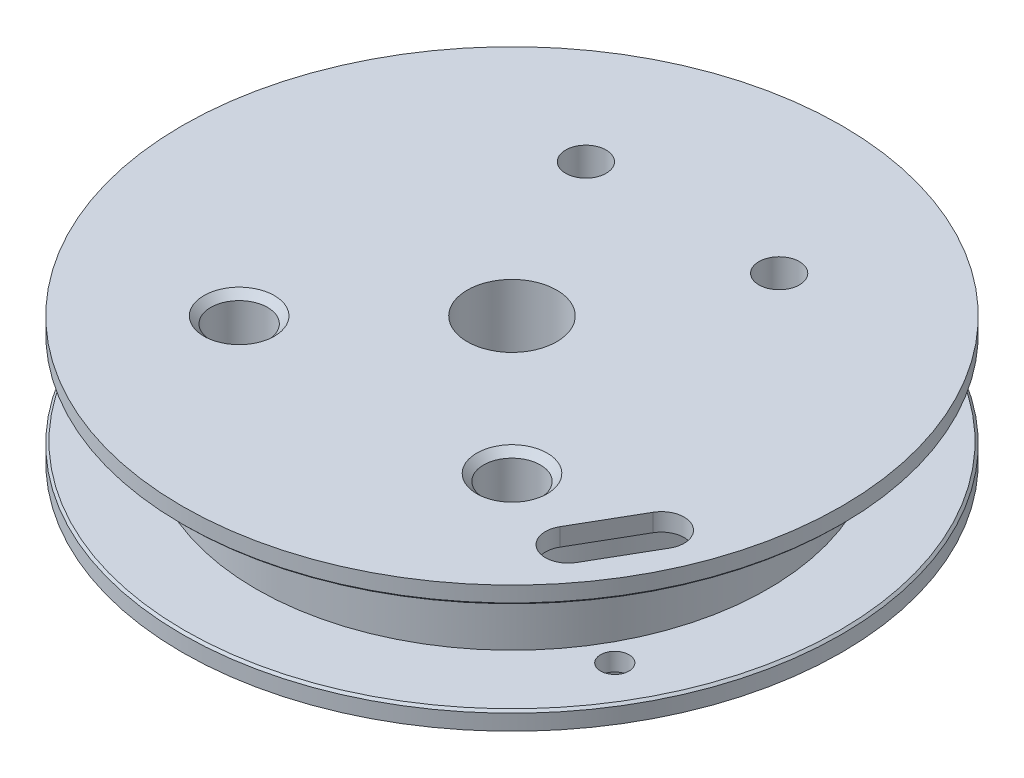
ISO-10303-21;
HEADER;
FILE_DESCRIPTION(('STEP AP214'),'2;1');
FILE_NAME('part.step','',(''),(''),'','','');
FILE_SCHEMA(('AUTOMOTIVE_DESIGN { 1 0 10303 214 1 1 1 1 }'));
ENDSEC;
DATA;
#1=APPLICATION_CONTEXT('core data for automotive mechanical design processes');
#2=APPLICATION_PROTOCOL_DEFINITION('international standard','automotive_design',2000,#1);
#3=PRODUCT_CONTEXT('',#1,'mechanical');
#4=PRODUCT('Part','Part','',(#3));
#5=PRODUCT_RELATED_PRODUCT_CATEGORY('part','',(#4));
#6=PRODUCT_DEFINITION_FORMATION('','',#4);
#7=PRODUCT_DEFINITION_CONTEXT('part definition',#1,'design');
#8=PRODUCT_DEFINITION('design','',#6,#7);
#9=PRODUCT_DEFINITION_SHAPE('','',#8);
#10=(LENGTH_UNIT() NAMED_UNIT(*) SI_UNIT(.MILLI.,.METRE.));
#11=(NAMED_UNIT(*) PLANE_ANGLE_UNIT() SI_UNIT($,.RADIAN.));
#12=(NAMED_UNIT(*) SI_UNIT($,.STERADIAN.) SOLID_ANGLE_UNIT());
#13=UNCERTAINTY_MEASURE_WITH_UNIT(LENGTH_MEASURE(1.E-05),#10,'distance_accuracy_value','');
#14=(GEOMETRIC_REPRESENTATION_CONTEXT(3) GLOBAL_UNCERTAINTY_ASSIGNED_CONTEXT((#13)) GLOBAL_UNIT_ASSIGNED_CONTEXT((#10,
#11,#12)) REPRESENTATION_CONTEXT('',''));
#15=CARTESIAN_POINT('',(0.,0.,0.));
#16=DIRECTION('',(0.,0.,1.));
#17=DIRECTION('',(1.,0.,0.));
#18=AXIS2_PLACEMENT_3D('',#15,#16,#17);
#19=CARTESIAN_POINT('',(0.,0.,0.));
#20=DIRECTION('',(0.,-1.,0.));
#21=DIRECTION('',(0.,0.,-1.));
#22=AXIS2_PLACEMENT_3D('',#19,#20,#21);
#23=CYLINDRICAL_SURFACE('',#22,9.525);
#24=CARTESIAN_POINT('',(-2.01929999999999,25.99396,9.30849356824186));
#25=CARTESIAN_POINT('',(-2.01929603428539,26.1060088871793,9.30849582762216));
#26=CARTESIAN_POINT('',(-2.00994207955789,26.2181062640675,9.31053873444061));
#27=CARTESIAN_POINT('',(-1.97281073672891,26.4391193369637,9.31847573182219));
#28=CARTESIAN_POINT('',(-1.94501950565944,26.5480325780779,9.32437271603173));
#29=CARTESIAN_POINT('',(-1.87192289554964,26.7594482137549,9.33932066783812));
#30=CARTESIAN_POINT('',(-1.82663606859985,26.8619572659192,9.34836829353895));
#31=CARTESIAN_POINT('',(-1.71988607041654,27.0579230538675,9.36859408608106));
#32=CARTESIAN_POINT('',(-1.65842344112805,27.1513800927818,9.37977218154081));
#33=CARTESIAN_POINT('',(-1.52002642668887,27.3280753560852,9.40319768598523));
#34=CARTESIAN_POINT('',(-1.44288400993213,27.4111489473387,9.41545806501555));
#35=CARTESIAN_POINT('',(-1.27576644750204,27.5632789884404,9.43955293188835));
#36=CARTESIAN_POINT('',(-1.18579034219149,27.632334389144,9.45138738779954));
#37=CARTESIAN_POINT('',(-0.994460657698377,27.7551145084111,9.47343774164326));
#38=CARTESIAN_POINT('',(-0.893003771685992,27.8086815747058,9.48363655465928));
#39=CARTESIAN_POINT('',(-0.682276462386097,27.8979454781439,9.50112028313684));
#40=CARTESIAN_POINT('',(-0.573006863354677,27.9336441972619,9.50840550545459));
#41=CARTESIAN_POINT('',(-0.351466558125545,27.985642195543,9.51914955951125));
#42=CARTESIAN_POINT('',(-0.239263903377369,28.0022198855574,9.52266325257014));
#43=CARTESIAN_POINT('',(-0.0136186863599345,28.0163750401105,9.52565820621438));
#44=CARTESIAN_POINT('',(0.0998237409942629,28.0139545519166,9.52513990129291));
#45=CARTESIAN_POINT('',(0.322811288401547,27.9903908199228,9.52017140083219));
#46=CARTESIAN_POINT('',(0.432389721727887,27.9695475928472,9.51578421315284));
#47=CARTESIAN_POINT('',(0.646457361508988,27.9102073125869,9.50364240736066));
#48=CARTESIAN_POINT('',(0.750946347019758,27.8717094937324,9.49588764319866));
#49=CARTESIAN_POINT('',(0.952710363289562,27.7778828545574,9.47777975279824));
#50=CARTESIAN_POINT('',(1.04993020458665,27.7224389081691,9.46740894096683));
#51=CARTESIAN_POINT('',(1.23379613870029,27.5963794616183,9.44520838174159));
#52=CARTESIAN_POINT('',(1.32044087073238,27.5257620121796,9.43337844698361));
#53=CARTESIAN_POINT('',(1.48248003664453,27.3697220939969,9.4092895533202));
#54=CARTESIAN_POINT('',(1.55762124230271,27.2840370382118,9.39702672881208));
#55=CARTESIAN_POINT('',(1.69251280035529,27.1011561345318,9.3736719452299));
#56=CARTESIAN_POINT('',(1.75226278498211,27.003960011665,9.36258001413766));
#57=CARTESIAN_POINT('',(1.85477896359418,26.8004235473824,9.3428135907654));
#58=CARTESIAN_POINT('',(1.89749984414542,26.6940597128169,9.33414556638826));
#59=CARTESIAN_POINT('',(1.96438678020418,26.4754362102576,9.3202997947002));
#60=CARTESIAN_POINT('',(1.98855558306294,26.3631774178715,9.31512153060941));
#61=CARTESIAN_POINT('',(2.01726482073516,26.138257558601,9.30894630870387));
#62=CARTESIAN_POINT('',(2.02217285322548,26.0256455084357,9.30787105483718));
#63=CARTESIAN_POINT('',(2.01321422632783,25.8012121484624,9.30981277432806));
#64=CARTESIAN_POINT('',(1.99934877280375,25.6893907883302,9.31282948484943));
#65=CARTESIAN_POINT('',(1.95355496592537,25.4709765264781,9.32254151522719));
#66=CARTESIAN_POINT('',(1.92182683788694,25.3643396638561,9.32919603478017));
#67=CARTESIAN_POINT('',(1.84142411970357,25.1578954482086,9.34539746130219));
#68=CARTESIAN_POINT('',(1.79274798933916,25.0580887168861,9.3549446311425));
#69=CARTESIAN_POINT('',(1.67901294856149,24.86654057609,9.37602908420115));
#70=CARTESIAN_POINT('',(1.61372627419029,24.7749374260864,9.38759326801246));
#71=CARTESIAN_POINT('',(1.46892346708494,24.6038523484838,9.41133676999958));
#72=CARTESIAN_POINT('',(1.38940567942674,24.5243718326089,9.42351615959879));
#73=CARTESIAN_POINT('',(1.21673926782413,24.378373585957,9.44737439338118));
#74=CARTESIAN_POINT('',(1.12337737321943,24.3121057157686,9.45904082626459));
#75=CARTESIAN_POINT('',(0.9266327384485,24.1961952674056,9.48033504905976));
#76=CARTESIAN_POINT('',(0.823250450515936,24.1465519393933,9.48996293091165));
#77=CARTESIAN_POINT('',(0.610022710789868,24.0656537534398,9.50604266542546));
#78=CARTESIAN_POINT('',(0.500221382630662,24.0342866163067,9.51251387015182));
#79=CARTESIAN_POINT('',(0.276755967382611,23.9904785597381,9.52163455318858));
#80=CARTESIAN_POINT('',(0.163092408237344,23.9780350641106,9.52428455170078));
#81=CARTESIAN_POINT('',(-0.0624937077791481,23.9725374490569,9.52544995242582));
#82=CARTESIAN_POINT('',(-0.174406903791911,23.9791093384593,9.52404510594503));
#83=CARTESIAN_POINT('',(-0.395495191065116,24.0106233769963,9.5174283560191));
#84=CARTESIAN_POINT('',(-0.504670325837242,24.0355652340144,9.51221651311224));
#85=CARTESIAN_POINT('',(-0.716914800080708,24.1029366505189,9.49857594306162));
#86=CARTESIAN_POINT('',(-0.82000066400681,24.145316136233,9.49015643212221));
#87=CARTESIAN_POINT('',(-1.01764972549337,24.2463097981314,9.4710023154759));
#88=CARTESIAN_POINT('',(-1.11221214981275,24.3049254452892,9.46026750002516));
#89=CARTESIAN_POINT('',(-1.29196368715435,24.4379625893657,9.43741599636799));
#90=CARTESIAN_POINT('',(-1.37695418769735,24.5126488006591,9.42527797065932));
#91=CARTESIAN_POINT('',(-1.53332402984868,24.6751692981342,9.4011072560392));
#92=CARTESIAN_POINT('',(-1.60470010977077,24.7630067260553,9.38907459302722));
#93=CARTESIAN_POINT('',(-1.73266295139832,24.9506442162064,9.36631153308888));
#94=CARTESIAN_POINT('',(-1.7890555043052,25.0505790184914,9.35559911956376));
#95=CARTESIAN_POINT('',(-1.88415679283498,25.2587101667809,9.33691305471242));
#96=CARTESIAN_POINT('',(-1.92288089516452,25.3668992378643,9.32893702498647));
#97=CARTESIAN_POINT('',(-1.97441124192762,25.5617017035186,9.3181451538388));
#98=CARTESIAN_POINT('',(-1.99121305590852,25.6472374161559,9.31454923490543));
#99=CARTESIAN_POINT('',(-2.01365873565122,25.8198257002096,9.30972261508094));
#100=CARTESIAN_POINT('',(-2.01930308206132,25.9068782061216,9.30849181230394));
#101=CARTESIAN_POINT('',(-2.01929999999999,25.99396,9.30849356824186));
#102=B_SPLINE_CURVE_WITH_KNOTS('',3,(#24,#25,#26,#27,#28,#29,#30,#31,#32,#33,#34,#35,#36,#37,
#38,#39,#40,#41,#42,#43,#44,#45,#46,#47,#48,#49,#50,#51,#52,#53,#54,#55,#56,#57,#58,#59,#60,#61,
#62,#63,#64,#65,#66,#67,#68,#69,#70,#71,#72,#73,#74,#75,#76,#77,#78,#79,#80,#81,#82,#83,#84,#85,
#86,#87,#88,#89,#90,#91,#92,#93,#94,#95,#96,#97,#98,#99,#100,#101),.UNSPECIFIED.,.T.,.F.,(4,2,2,
2,2,2,2,2,2,2,2,2,2,2,2,2,2,2,2,2,2,2,2,2,2,2,2,2,2,2,2,2,2,2,2,2,2,2,4),(0.,0.335827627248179,
0.671907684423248,1.00763234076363,1.34334575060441,1.68384405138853,2.02436782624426,
2.36824464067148,2.71208522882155,3.05085349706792,3.38958525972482,3.7229003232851,
4.05622984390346,4.39187621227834,4.72756572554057,5.06982184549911,5.41208614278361,
5.75525520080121,6.09837342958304,6.43491034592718,6.77142564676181,7.10424192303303,
7.43708845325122,7.77477121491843,8.11249327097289,8.45609694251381,8.79968511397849,
9.14113957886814,9.48254755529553,9.81728669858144,10.1520205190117,10.4857997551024,
10.8196092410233,11.1594078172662,11.4992876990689,11.8433789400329,12.187170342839,
12.4481790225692,12.7091764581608),.UNSPECIFIED.);
#103=CARTESIAN_POINT('',(-2.01929999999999,25.99396,9.30849356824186));
#104=VERTEX_POINT('',#103);
#105=EDGE_CURVE('E163',#104,#104,#102,.T.);
#106=ORIENTED_EDGE('',*,*,#105,.T.);
#107=EDGE_LOOP('',(#106));
#108=FACE_BOUND('',#107,.T.);
#109=CARTESIAN_POINT('',(0.,28.99396,0.));
#110=DIRECTION('',(0.,-1.,0.));
#111=DIRECTION('',(0.,0.,-1.));
#112=AXIS2_PLACEMENT_3D('',#109,#110,#111);
#113=CIRCLE('',#112,9.525);
#114=CARTESIAN_POINT('',(0.,28.99396,-9.525));
#115=VERTEX_POINT('',#114);
#116=EDGE_CURVE('E185',#115,#115,#113,.T.);
#117=ORIENTED_EDGE('',*,*,#116,.T.);
#118=EDGE_LOOP('',(#117));
#119=FACE_BOUND('',#118,.T.);
#120=CARTESIAN_POINT('',(0.,22.99396,0.));
#121=DIRECTION('',(0.,-1.,0.));
#122=DIRECTION('',(0.,0.,-1.));
#123=AXIS2_PLACEMENT_3D('',#120,#121,#122);
#124=CIRCLE('',#123,9.525);
#125=CARTESIAN_POINT('',(0.,22.99396,-9.525));
#126=VERTEX_POINT('',#125);
#127=EDGE_CURVE('E206',#126,#126,#124,.T.);
#128=ORIENTED_EDGE('',*,*,#127,.F.);
#129=EDGE_LOOP('',(#128));
#130=FACE_BOUND('',#129,.T.);
#131=ADVANCED_FACE('F76',(#108,#119,#130),#23,.T.);
#132=CARTESIAN_POINT('',(0.,0.,0.));
#133=DIRECTION('',(0.,-1.,0.));
#134=DIRECTION('',(0.,0.,-1.));
#135=AXIS2_PLACEMENT_3D('',#132,#133,#134);
#136=CYLINDRICAL_SURFACE('',#135,2.5);
#137=CARTESIAN_POINT('',(-2.01929999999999,25.99396,1.473915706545));
#138=CARTESIAN_POINT('',(-2.01929480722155,25.919142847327,1.47392817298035));
#139=CARTESIAN_POINT('',(-2.01509305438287,25.844201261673,1.47973177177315));
#140=CARTESIAN_POINT('',(-1.99869205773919,25.6967072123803,1.501799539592));
#141=CARTESIAN_POINT('',(-1.98646694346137,25.6241632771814,1.51809754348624));
#142=CARTESIAN_POINT('',(-1.9492780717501,25.4577362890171,1.56572883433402));
#143=CARTESIAN_POINT('',(-1.92132304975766,25.3654933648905,1.60035394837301));
#144=CARTESIAN_POINT('',(-1.85422314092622,25.1887107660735,1.67764101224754));
#145=CARTESIAN_POINT('',(-1.81504489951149,25.1041950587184,1.72032678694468));
#146=CARTESIAN_POINT('',(-1.74026753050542,24.967772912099,1.79536950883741));
#147=CARTESIAN_POINT('',(-1.70732483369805,24.9138804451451,1.82682556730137));
#148=CARTESIAN_POINT('',(-1.63673711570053,24.8096324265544,1.89033056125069));
#149=CARTESIAN_POINT('',(-1.59909033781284,24.7592782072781,1.92237971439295));
#150=CARTESIAN_POINT('',(-1.47926544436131,24.6136937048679,2.01796161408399));
#151=CARTESIAN_POINT('',(-1.39008353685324,24.5237249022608,2.08105533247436));
#152=CARTESIAN_POINT('',(-1.2133292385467,24.3766076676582,2.18775655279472));
#153=CARTESIAN_POINT('',(-1.12903037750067,24.3164965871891,2.23273276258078));
#154=CARTESIAN_POINT('',(-0.949376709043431,24.2086912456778,2.31481868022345));
#155=CARTESIAN_POINT('',(-0.854039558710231,24.1609775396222,2.35194069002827));
#156=CARTESIAN_POINT('',(-0.670326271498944,24.087034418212,2.41005502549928));
#157=CARTESIAN_POINT('',(-0.583378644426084,24.0585634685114,2.43269514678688));
#158=CARTESIAN_POINT('',(-0.404602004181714,24.0134678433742,2.46872242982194));
#159=CARTESIAN_POINT('',(-0.312775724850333,23.996836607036,2.48211471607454));
#160=CARTESIAN_POINT('',(-0.126426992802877,23.9764363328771,2.4985580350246));
#161=CARTESIAN_POINT('',(-0.0318960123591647,23.9727138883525,2.50157160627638));
#162=CARTESIAN_POINT('',(0.156486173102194,23.9785283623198,2.49687588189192));
#163=CARTESIAN_POINT('',(0.250337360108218,23.988065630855,2.48916630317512));
#164=CARTESIAN_POINT('',(0.429140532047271,24.0188209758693,2.46445221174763));
#165=CARTESIAN_POINT('',(0.514294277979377,24.0393382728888,2.44800573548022));
#166=CARTESIAN_POINT('',(0.679541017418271,24.0904672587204,2.4073786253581));
#167=CARTESIAN_POINT('',(0.759632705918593,24.1210815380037,2.38319600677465));
#168=CARTESIAN_POINT('',(0.920770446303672,24.1944278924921,2.32597640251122));
#169=CARTESIAN_POINT('',(1.00119655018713,24.2380294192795,2.29232018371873));
#170=CARTESIAN_POINT('',(1.15369505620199,24.334230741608,2.21949122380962));
#171=CARTESIAN_POINT('',(1.22576310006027,24.3868351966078,2.18031562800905));
#172=CARTESIAN_POINT('',(1.37523874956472,24.5115192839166,2.08993667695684));
#173=CARTESIAN_POINT('',(1.45066899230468,24.5853767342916,2.03792128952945));
#174=CARTESIAN_POINT('',(1.58880440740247,24.7432404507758,1.9321670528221));
#175=CARTESIAN_POINT('',(1.65149250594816,24.8272600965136,1.87842600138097));
#176=CARTESIAN_POINT('',(1.75958628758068,24.9985104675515,1.77733312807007));
#177=CARTESIAN_POINT('',(1.80592689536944,25.0850448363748,1.7298026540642));
#178=CARTESIAN_POINT('',(1.8864585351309,25.266849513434,1.64159022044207));
#179=CARTESIAN_POINT('',(1.92067607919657,25.3621001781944,1.60089342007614));
#180=CARTESIAN_POINT('',(1.96632640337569,25.5291809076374,1.54416456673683));
#181=CARTESIAN_POINT('',(1.98154800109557,25.5986796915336,1.52440993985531));
#182=CARTESIAN_POINT('',(2.00464734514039,25.7407522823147,1.49390856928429));
#183=CARTESIAN_POINT('',(2.01254234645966,25.8133184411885,1.48314066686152));
#184=CARTESIAN_POINT('',(2.02036345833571,25.9602168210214,1.47247617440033));
#185=CARTESIAN_POINT('',(2.02023580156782,26.0345576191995,1.47265293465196));
#186=CARTESIAN_POINT('',(2.01188939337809,26.1819590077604,1.48402871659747));
#187=CARTESIAN_POINT('',(2.00365994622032,26.2550177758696,1.49524230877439));
#188=CARTESIAN_POINT('',(1.97703934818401,26.4145281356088,1.53032338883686));
#189=CARTESIAN_POINT('',(1.95672334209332,26.5001210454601,1.55653509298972));
#190=CARTESIAN_POINT('',(1.90644977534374,26.6651619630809,1.61771969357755));
#191=CARTESIAN_POINT('',(1.87646281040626,26.7445903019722,1.65271923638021));
#192=CARTESIAN_POINT('',(1.79115590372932,26.9346478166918,1.74568689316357));
#193=CARTESIAN_POINT('',(1.73061991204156,27.0415265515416,1.80651395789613));
#194=CARTESIAN_POINT('',(1.59198575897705,27.2421681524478,1.92983341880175));
#195=CARTESIAN_POINT('',(1.51386486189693,27.3359137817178,1.99232787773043));
#196=CARTESIAN_POINT('',(1.33868834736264,27.510893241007,2.11412370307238));
#197=CARTESIAN_POINT('',(1.24130762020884,27.5918619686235,2.17334407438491));
#198=CARTESIAN_POINT('',(1.02924522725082,27.7359503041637,2.28138266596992));
#199=CARTESIAN_POINT('',(0.914620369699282,27.7991266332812,2.33023381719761));
#200=CARTESIAN_POINT('',(0.709566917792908,27.8866429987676,2.39879190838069));
#201=CARTESIAN_POINT('',(0.623112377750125,27.9169420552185,2.42282352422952));
#202=CARTESIAN_POINT('',(0.444963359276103,27.9657827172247,2.46176594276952));
#203=CARTESIAN_POINT('',(0.353272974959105,27.9843333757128,2.47668376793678));
#204=CARTESIAN_POINT('',(0.166706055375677,28.0085725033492,2.49620492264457));
#205=CARTESIAN_POINT('',(0.0718178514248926,28.0142071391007,2.50076508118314));
#206=CARTESIAN_POINT('',(-0.117708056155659,28.0120521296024,2.49902432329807));
#207=CARTESIAN_POINT('',(-0.212345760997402,28.0042625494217,2.49272345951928));
#208=CARTESIAN_POINT('',(-0.392478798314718,27.9767152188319,2.47056373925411));
#209=CARTESIAN_POINT('',(-0.478175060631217,27.9577396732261,2.45532988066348));
#210=CARTESIAN_POINT('',(-0.644740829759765,27.9095294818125,2.41694473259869));
#211=CARTESIAN_POINT('',(-0.725609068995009,27.880292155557,2.39379137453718));
#212=CARTESIAN_POINT('',(-0.887671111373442,27.8100145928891,2.33879505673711));
#213=CARTESIAN_POINT('',(-0.968331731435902,27.7681944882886,2.30638921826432));
#214=CARTESIAN_POINT('',(-1.12154463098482,27.6755476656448,2.23590280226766));
#215=CARTESIAN_POINT('',(-1.19409338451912,27.6247170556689,2.19781977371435));
#216=CARTESIAN_POINT('',(-1.34451441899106,27.5042338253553,2.10981567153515));
#217=CARTESIAN_POINT('',(-1.4205080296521,27.4328528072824,2.05905632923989));
#218=CARTESIAN_POINT('',(-1.5601644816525,27.280114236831,1.95536659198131));
#219=CARTESIAN_POINT('',(-1.62380894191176,27.1987421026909,1.90243310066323));
#220=CARTESIAN_POINT('',(-1.73723779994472,27.0282979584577,1.79937292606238));
#221=CARTESIAN_POINT('',(-1.78728237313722,26.9394207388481,1.749210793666));
#222=CARTESIAN_POINT('',(-1.87436590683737,26.7522075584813,1.65554058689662));
#223=CARTESIAN_POINT('',(-1.91142967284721,26.6538901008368,1.61201991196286));
#224=CARTESIAN_POINT('',(-1.96080868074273,26.4817726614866,1.55120482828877));
#225=CARTESIAN_POINT('',(-1.97725454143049,26.4105688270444,1.52999393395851));
#226=CARTESIAN_POINT('',(-2.00240730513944,26.2647970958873,1.49693379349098));
#227=CARTESIAN_POINT('',(-2.01114425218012,26.1902434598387,1.48504822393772));
#228=CARTESIAN_POINT('',(-2.01687486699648,26.0949488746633,1.47723289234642));
#229=CARTESIAN_POINT('',(-2.01778274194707,26.0747861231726,1.47599261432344));
#230=CARTESIAN_POINT('',(-2.01899607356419,26.0344052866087,1.47433225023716));
#231=CARTESIAN_POINT('',(-2.01930140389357,26.014187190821,1.47391233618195));
#232=CARTESIAN_POINT('',(-2.01929999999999,25.99396,1.473915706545));
#233=B_SPLINE_CURVE_WITH_KNOTS('',3,(#137,#138,#139,#140,#141,#142,#143,#144,#145,#146,#147,
#148,#149,#150,#151,#152,#153,#154,#155,#156,#157,#158,#159,#160,#161,#162,#163,#164,#165,#166,
#167,#168,#169,#170,#171,#172,#173,#174,#175,#176,#177,#178,#179,#180,#181,#182,#183,#184,#185,
#186,#187,#188,#189,#190,#191,#192,#193,#194,#195,#196,#197,#198,#199,#200,#201,#202,#203,#204,
#205,#206,#207,#208,#209,#210,#211,#212,#213,#214,#215,#216,#217,#218,#219,#220,#221,#222,#223,
#224,#225,#226,#227,#228,#229,#230,#231,#232),.UNSPECIFIED.,.T.,.F.,(4,2,2,2,2,2,2,2,2,2,2,2,2,
2,2,2,2,2,2,2,2,2,2,2,2,2,2,2,2,2,2,2,2,2,2,2,2,2,2,2,2,2,2,2,2,2,2,4),(0.,0.224362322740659,
0.449451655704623,0.754990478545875,1.06144693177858,1.27288816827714,1.48440860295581,
1.90662570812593,2.2440511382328,2.58094408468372,2.86250451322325,3.14390879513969,
3.42632773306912,3.70875412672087,3.97499404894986,4.24130233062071,4.53268072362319,
4.82421037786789,5.17602246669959,5.52830290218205,5.85454510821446,6.18006938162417,
6.4008027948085,6.62101502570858,6.84270326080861,7.06468455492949,7.33852607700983,
7.61320818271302,8.02229646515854,8.43191673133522,8.84915467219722,9.26504702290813,
9.5480293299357,9.83079331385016,10.1147337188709,10.3986727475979,10.6647829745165,
10.9309627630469,11.2192984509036,11.5077589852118,11.8544132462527,12.2015795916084,
12.5415427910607,12.8808527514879,13.1083575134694,13.3349716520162,13.3956164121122,
13.4562738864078),.UNSPECIFIED.);
#234=CARTESIAN_POINT('',(-2.01929999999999,25.99396,1.473915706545));
#235=VERTEX_POINT('',#234);
#236=EDGE_CURVE('E80',#235,#235,#233,.T.);
#237=ORIENTED_EDGE('',*,*,#236,.T.);
#238=EDGE_LOOP('',(#237));
#239=FACE_BOUND('',#238,.T.);
#240=CARTESIAN_POINT('',(0.,22.99396,0.));
#241=DIRECTION('',(0.,-1.,0.));
#242=DIRECTION('',(0.,0.,-1.));
#243=AXIS2_PLACEMENT_3D('',#240,#241,#242);
#244=CIRCLE('',#243,2.5);
#245=CARTESIAN_POINT('',(0.,22.99396,-2.5));
#246=VERTEX_POINT('',#245);
#247=EDGE_CURVE('E203',#246,#246,#244,.T.);
#248=ORIENTED_EDGE('',*,*,#247,.T.);
#249=EDGE_LOOP('',(#248));
#250=FACE_BOUND('',#249,.T.);
#251=CARTESIAN_POINT('',(0.,36.06456,0.));
#252=DIRECTION('',(0.,-1.,0.));
#253=DIRECTION('',(0.,0.,-1.));
#254=AXIS2_PLACEMENT_3D('',#251,#252,#253);
#255=CIRCLE('',#254,2.5);
#256=CARTESIAN_POINT('',(0.,36.06456,-2.5));
#257=VERTEX_POINT('',#256);
#258=EDGE_CURVE('E200',#257,#257,#255,.T.);
#259=ORIENTED_EDGE('',*,*,#258,.F.);
#260=EDGE_LOOP('',(#259));
#261=FACE_BOUND('',#260,.T.);
#262=ADVANCED_FACE('F260',(#239,#250,#261),#136,.F.);
#263=CARTESIAN_POINT('',(-2.5,22.99396,0.));
#264=DIRECTION('',(0.,1.,0.));
#265=DIRECTION('',(0.,0.,1.));
#266=AXIS2_PLACEMENT_3D('',#263,#264,#265);
#267=PLANE('',#266);
#268=ORIENTED_EDGE('',*,*,#247,.F.);
#269=EDGE_LOOP('',(#268));
#270=FACE_BOUND('',#269,.T.);
#271=ORIENTED_EDGE('',*,*,#127,.T.);
#272=EDGE_LOOP('',(#271));
#273=FACE_BOUND('',#272,.T.);
#274=ADVANCED_FACE('F266',(#270,#273),#267,.F.);
#275=CARTESIAN_POINT('',(-18.415,36.06456,0.));
#276=DIRECTION('',(0.,-1.,0.));
#277=DIRECTION('',(0.,0.,-1.));
#278=AXIS2_PLACEMENT_3D('',#275,#276,#277);
#279=PLANE('',#278);
#280=CARTESIAN_POINT('',(7.62,36.06456,7.62));
#281=DIRECTION('',(0.,-1.,0.));
#282=DIRECTION('',(0.,0.,-1.));
#283=AXIS2_PLACEMENT_3D('',#280,#281,#282);
#284=CIRCLE('',#283,1.9685);
#285=CARTESIAN_POINT('',(7.62,36.06456,5.6515));
#286=VERTEX_POINT('',#285);
#287=EDGE_CURVE('E89',#286,#286,#284,.T.);
#288=ORIENTED_EDGE('',*,*,#287,.T.);
#289=EDGE_LOOP('',(#288));
#290=FACE_BOUND('',#289,.T.);
#291=CARTESIAN_POINT('',(-7.61999999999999,36.06456,7.62));
#292=DIRECTION('',(0.,-1.,0.));
#293=DIRECTION('',(0.,0.,-1.));
#294=AXIS2_PLACEMENT_3D('',#291,#292,#293);
#295=CIRCLE('',#294,1.9685);
#296=CARTESIAN_POINT('',(-7.61999999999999,36.06456,5.6515));
#297=VERTEX_POINT('',#296);
#298=EDGE_CURVE('E226',#297,#297,#295,.T.);
#299=ORIENTED_EDGE('',*,*,#298,.T.);
#300=EDGE_LOOP('',(#299));
#301=FACE_BOUND('',#300,.T.);
#302=DIRECTION('',(-0.499999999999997,0.,0.866025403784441));
#303=VECTOR('',#302,1.);
#304=CARTESIAN_POINT('',(13.4358231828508,36.06456,5.55747160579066));
#305=LINE('',#304,#303);
#306=CARTESIAN_POINT('',(13.4358231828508,36.06456,5.55747160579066));
#307=VERTEX_POINT('',#306);
#308=CARTESIAN_POINT('',(11.5308231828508,36.06456,8.85702839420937));
#309=VERTEX_POINT('',#308);
#310=EDGE_CURVE('E579',#307,#309,#305,.T.);
#311=ORIENTED_EDGE('',*,*,#310,.F.);
#312=CARTESIAN_POINT('',(14.535675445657,36.06456,6.19247160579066));
#313=DIRECTION('',(0.,1.,0.));
#314=DIRECTION('',(0.,0.,1.));
#315=AXIS2_PLACEMENT_3D('',#312,#313,#314);
#316=CIRCLE('',#315,1.27000000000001);
#317=CARTESIAN_POINT('',(15.6355277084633,36.06456,6.82747160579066));
#318=VERTEX_POINT('',#317);
#319=EDGE_CURVE('E96',#318,#307,#316,.T.);
#320=ORIENTED_EDGE('',*,*,#319,.F.);
#321=DIRECTION('',(0.499999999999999,0.,-0.866025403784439));
#322=VECTOR('',#321,1.);
#323=CARTESIAN_POINT('',(15.6355277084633,36.06456,6.82747160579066));
#324=LINE('',#323,#322);
#325=CARTESIAN_POINT('',(13.7305277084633,36.06456,10.1270283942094));
#326=VERTEX_POINT('',#325);
#327=EDGE_CURVE('E140',#326,#318,#324,.T.);
#328=ORIENTED_EDGE('',*,*,#327,.F.);
#329=CARTESIAN_POINT('',(12.630675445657,36.06456,9.49202839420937));
#330=DIRECTION('',(0.,1.,0.));
#331=DIRECTION('',(0.,0.,1.));
#332=AXIS2_PLACEMENT_3D('',#329,#330,#331);
#333=CIRCLE('',#332,1.27);
#334=EDGE_CURVE('E586',#309,#326,#333,.T.);
#335=ORIENTED_EDGE('',*,*,#334,.F.);
#336=EDGE_LOOP('',(#311,#320,#328,#335));
#337=FACE_BOUND('',#336,.T.);
#338=CARTESIAN_POINT('',(5.3975,36.06456,-9.525));
#339=DIRECTION('',(0.,1.,0.));
#340=DIRECTION('',(0.,0.,1.));
#341=AXIS2_PLACEMENT_3D('',#338,#339,#340);
#342=CIRCLE('',#341,1.1303);
#343=CARTESIAN_POINT('',(5.3975,36.06456,-8.3947));
#344=VERTEX_POINT('',#343);
#345=EDGE_CURVE('E155',#344,#344,#342,.T.);
#346=ORIENTED_EDGE('',*,*,#345,.F.);
#347=EDGE_LOOP('',(#346));
#348=FACE_BOUND('',#347,.T.);
#349=CARTESIAN_POINT('',(-5.3975,36.06456,-9.525));
#350=DIRECTION('',(0.,1.,0.));
#351=DIRECTION('',(0.,0.,1.));
#352=AXIS2_PLACEMENT_3D('',#349,#350,#351);
#353=CIRCLE('',#352,1.1303);
#354=CARTESIAN_POINT('',(-5.3975,36.06456,-8.3947));
#355=VERTEX_POINT('',#354);
#356=EDGE_CURVE('E169',#355,#355,#353,.T.);
#357=ORIENTED_EDGE('',*,*,#356,.F.);
#358=EDGE_LOOP('',(#357));
#359=FACE_BOUND('',#358,.T.);
#360=CARTESIAN_POINT('',(0.,36.06456,0.));
#361=DIRECTION('',(0.,-1.,0.));
#362=DIRECTION('',(0.,0.,-1.));
#363=AXIS2_PLACEMENT_3D('',#360,#361,#362);
#364=CIRCLE('',#363,18.415);
#365=CARTESIAN_POINT('',(0.,36.06456,-18.415));
#366=VERTEX_POINT('',#365);
#367=EDGE_CURVE('E197',#366,#366,#364,.T.);
#368=ORIENTED_EDGE('',*,*,#367,.F.);
#369=EDGE_LOOP('',(#368));
#370=FACE_BOUND('',#369,.T.);
#371=ORIENTED_EDGE('',*,*,#258,.T.);
#372=EDGE_LOOP('',(#371));
#373=FACE_BOUND('',#372,.T.);
#374=ADVANCED_FACE('F232',(#290,#301,#337,#348,#359,#370,#373),#279,.F.);
#375=CARTESIAN_POINT('',(0.,0.,0.));
#376=DIRECTION('',(0.,-1.,0.));
#377=DIRECTION('',(0.,0.,-1.));
#378=AXIS2_PLACEMENT_3D('',#375,#376,#377);
#379=CYLINDRICAL_SURFACE('',#378,18.415);
#380=CARTESIAN_POINT('',(0.,35.20096,0.));
#381=DIRECTION('',(0.,1.,0.));
#382=DIRECTION('',(0.,0.,1.));
#383=AXIS2_PLACEMENT_3D('',#380,#381,#382);
#384=CIRCLE('',#383,18.415);
#385=CARTESIAN_POINT('',(0.,35.20096,18.415));
#386=VERTEX_POINT('',#385);
#387=EDGE_CURVE('E214',#386,#386,#384,.T.);
#388=ORIENTED_EDGE('',*,*,#387,.T.);
#389=EDGE_LOOP('',(#388));
#390=FACE_BOUND('',#389,.T.);
#391=ORIENTED_EDGE('',*,*,#367,.T.);
#392=EDGE_LOOP('',(#391));
#393=FACE_BOUND('',#392,.T.);
#394=ADVANCED_FACE('F457',(#390,#393),#379,.T.);
#395=CARTESIAN_POINT('',(-14.2875,35.07396,0.));
#396=DIRECTION('',(0.,1.,0.));
#397=DIRECTION('',(0.,0.,1.));
#398=AXIS2_PLACEMENT_3D('',#395,#396,#397);
#399=PLANE('',#398);
#400=CARTESIAN_POINT('',(0.,35.07396,0.));
#401=DIRECTION('',(0.,1.,0.));
#402=DIRECTION('',(0.,0.,1.));
#403=AXIS2_PLACEMENT_3D('',#400,#401,#402);
#404=CIRCLE('',#403,18.288);
#405=CARTESIAN_POINT('',(0.,35.07396,18.288));
#406=VERTEX_POINT('',#405);
#407=EDGE_CURVE('E209',#406,#406,#404,.F.);
#408=ORIENTED_EDGE('',*,*,#407,.T.);
#409=EDGE_LOOP('',(#408));
#410=FACE_BOUND('',#409,.T.);
#411=DIRECTION('',(-0.499999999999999,0.,0.866025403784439));
#412=VECTOR('',#411,1.);
#413=CARTESIAN_POINT('',(15.6355277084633,35.07396,6.82747160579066));
#414=LINE('',#413,#412);
#415=CARTESIAN_POINT('',(15.6355277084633,35.07396,6.82747160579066));
#416=VERTEX_POINT('',#415);
#417=CARTESIAN_POINT('',(13.7305277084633,35.07396,10.1270283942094));
#418=VERTEX_POINT('',#417);
#419=EDGE_CURVE('E138',#416,#418,#414,.T.);
#420=ORIENTED_EDGE('',*,*,#419,.F.);
#421=CARTESIAN_POINT('',(14.535675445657,35.07396,6.19247160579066));
#422=DIRECTION('',(0.,1.,0.));
#423=DIRECTION('',(0.,0.,1.));
#424=AXIS2_PLACEMENT_3D('',#421,#422,#423);
#425=CIRCLE('',#424,1.27000000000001);
#426=CARTESIAN_POINT('',(13.4358231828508,35.07396,5.55747160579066));
#427=VERTEX_POINT('',#426);
#428=EDGE_CURVE('E145',#427,#416,#425,.F.);
#429=ORIENTED_EDGE('',*,*,#428,.F.);
#430=DIRECTION('',(0.499999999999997,0.,-0.86602540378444));
#431=VECTOR('',#430,1.);
#432=CARTESIAN_POINT('',(13.4358231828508,35.07396,5.55747160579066));
#433=LINE('',#432,#431);
#434=CARTESIAN_POINT('',(11.5308231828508,35.07396,8.85702839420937));
#435=VERTEX_POINT('',#434);
#436=EDGE_CURVE('E150',#435,#427,#433,.T.);
#437=ORIENTED_EDGE('',*,*,#436,.F.);
#438=CARTESIAN_POINT('',(12.630675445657,35.07396,9.49202839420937));
#439=DIRECTION('',(0.,1.,0.));
#440=DIRECTION('',(0.,0.,1.));
#441=AXIS2_PLACEMENT_3D('',#438,#439,#440);
#442=CIRCLE('',#441,1.27);
#443=EDGE_CURVE('E104',#418,#435,#442,.F.);
#444=ORIENTED_EDGE('',*,*,#443,.F.);
#445=EDGE_LOOP('',(#420,#429,#437,#444));
#446=FACE_BOUND('',#445,.T.);
#447=CARTESIAN_POINT('',(0.,35.07396,0.));
#448=DIRECTION('',(0.,-1.,0.));
#449=DIRECTION('',(0.,0.,-1.));
#450=AXIS2_PLACEMENT_3D('',#447,#448,#449);
#451=CIRCLE('',#450,14.2875);
#452=CARTESIAN_POINT('',(0.,35.07396,-14.2875));
#453=VERTEX_POINT('',#452);
#454=EDGE_CURVE('E194',#453,#453,#451,.T.);
#455=ORIENTED_EDGE('',*,*,#454,.F.);
#456=EDGE_LOOP('',(#455));
#457=FACE_BOUND('',#456,.T.);
#458=ADVANCED_FACE('F152',(#410,#446,#457),#399,.F.);
#459=CARTESIAN_POINT('',(0.,0.,0.));
#460=DIRECTION('',(0.,-1.,0.));
#461=DIRECTION('',(0.,0.,-1.));
#462=AXIS2_PLACEMENT_3D('',#459,#460,#461);
#463=CYLINDRICAL_SURFACE('',#462,14.2875);
#464=CARTESIAN_POINT('',(0.,29.99396,0.));
#465=DIRECTION('',(0.,-1.,0.));
#466=DIRECTION('',(0.,0.,-1.));
#467=AXIS2_PLACEMENT_3D('',#464,#465,#466);
#468=CIRCLE('',#467,14.2875);
#469=CARTESIAN_POINT('',(0.,29.99396,-14.2875));
#470=VERTEX_POINT('',#469);
#471=EDGE_CURVE('E191',#470,#470,#468,.T.);
#472=ORIENTED_EDGE('',*,*,#471,.F.);
#473=EDGE_LOOP('',(#472));
#474=FACE_BOUND('',#473,.T.);
#475=ORIENTED_EDGE('',*,*,#454,.T.);
#476=EDGE_LOOP('',(#475));
#477=FACE_BOUND('',#476,.T.);
#478=ADVANCED_FACE('F470',(#474,#477),#463,.T.);
#479=CARTESIAN_POINT('',(-18.415,29.99396,0.));
#480=DIRECTION('',(0.,-1.,0.));
#481=DIRECTION('',(0.,0.,-1.));
#482=AXIS2_PLACEMENT_3D('',#479,#480,#481);
#483=PLANE('',#482);
#484=CARTESIAN_POINT('',(0.,29.99396,0.));
#485=DIRECTION('',(0.,-1.,0.));
#486=DIRECTION('',(0.,0.,-1.));
#487=AXIS2_PLACEMENT_3D('',#484,#485,#486);
#488=CIRCLE('',#487,18.288);
#489=CARTESIAN_POINT('',(0.,29.99396,-18.288));
#490=VERTEX_POINT('',#489);
#491=EDGE_CURVE('E220',#490,#490,#488,.F.);
#492=ORIENTED_EDGE('',*,*,#491,.T.);
#493=EDGE_LOOP('',(#492));
#494=FACE_BOUND('',#493,.T.);
#495=CARTESIAN_POINT('',(13.583175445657,29.99396,7.84225000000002));
#496=DIRECTION('',(0.,1.,0.));
#497=DIRECTION('',(0.,0.,1.));
#498=AXIS2_PLACEMENT_3D('',#495,#496,#497);
#499=CIRCLE('',#498,0.793750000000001);
#500=CARTESIAN_POINT('',(13.583175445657,29.99396,8.63600000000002));
#501=VERTEX_POINT('',#500);
#502=EDGE_CURVE('E181',#501,#501,#499,.T.);
#503=ORIENTED_EDGE('',*,*,#502,.F.);
#504=EDGE_LOOP('',(#503));
#505=FACE_BOUND('',#504,.T.);
#506=ORIENTED_EDGE('',*,*,#471,.T.);
#507=EDGE_LOOP('',(#506));
#508=FACE_BOUND('',#507,.T.);
#509=ADVANCED_FACE('F478',(#494,#505,#508),#483,.F.);
#510=CARTESIAN_POINT('',(0.,0.,0.));
#511=DIRECTION('',(0.,-1.,0.));
#512=DIRECTION('',(0.,0.,-1.));
#513=AXIS2_PLACEMENT_3D('',#510,#511,#512);
#514=CYLINDRICAL_SURFACE('',#513,18.415);
#515=CARTESIAN_POINT('',(0.,29.86696,0.));
#516=DIRECTION('',(0.,-1.,0.));
#517=DIRECTION('',(0.,0.,-1.));
#518=AXIS2_PLACEMENT_3D('',#515,#516,#517);
#519=CIRCLE('',#518,18.415);
#520=CARTESIAN_POINT('',(0.,29.86696,-18.415));
#521=VERTEX_POINT('',#520);
#522=EDGE_CURVE('E217',#521,#521,#519,.T.);
#523=ORIENTED_EDGE('',*,*,#522,.T.);
#524=EDGE_LOOP('',(#523));
#525=FACE_BOUND('',#524,.T.);
#526=CARTESIAN_POINT('',(0.,28.99396,0.));
#527=DIRECTION('',(0.,-1.,0.));
#528=DIRECTION('',(0.,0.,-1.));
#529=AXIS2_PLACEMENT_3D('',#526,#527,#528);
#530=CIRCLE('',#529,18.415);
#531=CARTESIAN_POINT('',(0.,28.99396,-18.415));
#532=VERTEX_POINT('',#531);
#533=EDGE_CURVE('E188',#532,#532,#530,.T.);
#534=ORIENTED_EDGE('',*,*,#533,.F.);
#535=EDGE_LOOP('',(#534));
#536=FACE_BOUND('',#535,.T.);
#537=ADVANCED_FACE('F486',(#525,#536),#514,.T.);
#538=CARTESIAN_POINT('',(-9.525,28.99396,0.));
#539=DIRECTION('',(0.,1.,0.));
#540=DIRECTION('',(0.,0.,1.));
#541=AXIS2_PLACEMENT_3D('',#538,#539,#540);
#542=PLANE('',#541);
#543=CARTESIAN_POINT('',(13.583175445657,28.99396,7.84225000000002));
#544=DIRECTION('',(0.,1.,0.));
#545=DIRECTION('',(0.,0.,1.));
#546=AXIS2_PLACEMENT_3D('',#543,#544,#545);
#547=CIRCLE('',#546,0.793750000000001);
#548=CARTESIAN_POINT('',(13.583175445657,28.99396,8.63600000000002));
#549=VERTEX_POINT('',#548);
#550=EDGE_CURVE('E184',#549,#549,#547,.T.);
#551=ORIENTED_EDGE('',*,*,#550,.T.);
#552=EDGE_LOOP('',(#551));
#553=FACE_BOUND('',#552,.T.);
#554=ORIENTED_EDGE('',*,*,#116,.F.);
#555=EDGE_LOOP('',(#554));
#556=FACE_BOUND('',#555,.T.);
#557=ORIENTED_EDGE('',*,*,#533,.T.);
#558=EDGE_LOOP('',(#557));
#559=FACE_BOUND('',#558,.T.);
#560=ADVANCED_FACE('F256',(#553,#556,#559),#542,.F.);
#561=CARTESIAN_POINT('',(13.583175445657,27.45396,7.84225000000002));
#562=DIRECTION('',(0.,1.,0.));
#563=DIRECTION('',(0.,0.,1.));
#564=AXIS2_PLACEMENT_3D('',#561,#562,#563);
#565=CYLINDRICAL_SURFACE('',#564,0.793750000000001);
#566=ORIENTED_EDGE('',*,*,#502,.T.);
#567=EDGE_LOOP('',(#566));
#568=FACE_BOUND('',#567,.T.);
#569=ORIENTED_EDGE('',*,*,#550,.F.);
#570=EDGE_LOOP('',(#569));
#571=FACE_BOUND('',#570,.T.);
#572=ADVANCED_FACE('F250',(#568,#571),#565,.F.);
#573=CARTESIAN_POINT('',(7.62,30.98456,7.62));
#574=DIRECTION('',(0.,1.,0.));
#575=DIRECTION('',(0.,0.,1.));
#576=AXIS2_PLACEMENT_3D('',#573,#574,#575);
#577=CONICAL_SURFACE('',#576,1.5875,1.02974425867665);
#578=CARTESIAN_POINT('',(7.62,30.0306937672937,7.62));
#579=VERTEX_POINT('',#578);
#580=VERTEX_LOOP('',#579);
#581=FACE_BOUND('',#580,.T.);
#582=CARTESIAN_POINT('',(7.62,30.98456,7.62));
#583=DIRECTION('',(0.,1.,0.));
#584=DIRECTION('',(0.,0.,1.));
#585=AXIS2_PLACEMENT_3D('',#582,#583,#584);
#586=CIRCLE('',#585,1.5875);
#587=CARTESIAN_POINT('',(7.62,30.98456,9.2075));
#588=VERTEX_POINT('',#587);
#589=EDGE_CURVE('E178',#588,#588,#586,.T.);
#590=ORIENTED_EDGE('',*,*,#589,.T.);
#591=EDGE_LOOP('',(#590));
#592=FACE_BOUND('',#591,.T.);
#593=ADVANCED_FACE('F245',(#581,#592),#577,.F.);
#594=CARTESIAN_POINT('',(7.62,36.06456,7.62));
#595=DIRECTION('',(0.,1.,0.));
#596=DIRECTION('',(0.,0.,1.));
#597=AXIS2_PLACEMENT_3D('',#594,#595,#596);
#598=CYLINDRICAL_SURFACE('',#597,1.58749999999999);
#599=CARTESIAN_POINT('',(7.62,35.68356,7.62));
#600=DIRECTION('',(0.,-1.,0.));
#601=DIRECTION('',(0.,0.,-1.));
#602=AXIS2_PLACEMENT_3D('',#599,#600,#601);
#603=CIRCLE('',#602,1.58749999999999);
#604=CARTESIAN_POINT('',(7.62,35.68356,6.03250000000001));
#605=VERTEX_POINT('',#604);
#606=EDGE_CURVE('E223',#605,#605,#603,.F.);
#607=ORIENTED_EDGE('',*,*,#606,.T.);
#608=EDGE_LOOP('',(#607));
#609=FACE_BOUND('',#608,.T.);
#610=ORIENTED_EDGE('',*,*,#589,.F.);
#611=EDGE_LOOP('',(#610));
#612=FACE_BOUND('',#611,.T.);
#613=ADVANCED_FACE('F241',(#609,#612),#598,.F.);
#614=CARTESIAN_POINT('',(-7.61999999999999,30.98456,7.62));
#615=DIRECTION('',(0.,1.,0.));
#616=DIRECTION('',(0.,0.,1.));
#617=AXIS2_PLACEMENT_3D('',#614,#615,#616);
#618=CONICAL_SURFACE('',#617,1.5875,1.02974425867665);
#619=CARTESIAN_POINT('',(-7.62,30.0306937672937,7.62));
#620=VERTEX_POINT('',#619);
#621=VERTEX_LOOP('',#620);
#622=FACE_BOUND('',#621,.T.);
#623=CARTESIAN_POINT('',(-7.61999999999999,30.98456,7.62));
#624=DIRECTION('',(0.,1.,0.));
#625=DIRECTION('',(0.,0.,1.));
#626=AXIS2_PLACEMENT_3D('',#623,#624,#625);
#627=CIRCLE('',#626,1.5875);
#628=CARTESIAN_POINT('',(-7.61999999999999,30.98456,9.2075));
#629=VERTEX_POINT('',#628);
#630=EDGE_CURVE('E175',#629,#629,#627,.T.);
#631=ORIENTED_EDGE('',*,*,#630,.T.);
#632=EDGE_LOOP('',(#631));
#633=FACE_BOUND('',#632,.T.);
#634=ADVANCED_FACE('F244',(#622,#633),#618,.F.);
#635=CARTESIAN_POINT('',(-7.61999999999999,36.06456,7.62));
#636=DIRECTION('',(0.,1.,0.));
#637=DIRECTION('',(0.,0.,1.));
#638=AXIS2_PLACEMENT_3D('',#635,#636,#637);
#639=CYLINDRICAL_SURFACE('',#638,1.58749999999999);
#640=CARTESIAN_POINT('',(-7.61999999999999,35.68356,7.62));
#641=DIRECTION('',(0.,-1.,0.));
#642=DIRECTION('',(0.,0.,-1.));
#643=AXIS2_PLACEMENT_3D('',#640,#641,#642);
#644=CIRCLE('',#643,1.58749999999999);
#645=CARTESIAN_POINT('',(-7.61999999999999,35.68356,6.03250000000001));
#646=VERTEX_POINT('',#645);
#647=EDGE_CURVE('E12',#646,#646,#644,.F.);
#648=ORIENTED_EDGE('',*,*,#647,.T.);
#649=EDGE_LOOP('',(#648));
#650=FACE_BOUND('',#649,.T.);
#651=ORIENTED_EDGE('',*,*,#630,.F.);
#652=EDGE_LOOP('',(#651));
#653=FACE_BOUND('',#652,.T.);
#654=ADVANCED_FACE('F312',(#650,#653),#639,.F.);
#655=CARTESIAN_POINT('',(-5.3975,30.34956,-9.525));
#656=DIRECTION('',(0.,1.,0.));
#657=DIRECTION('',(0.,0.,1.));
#658=AXIS2_PLACEMENT_3D('',#655,#656,#657);
#659=CONICAL_SURFACE('',#658,1.1303,1.02974425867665);
#660=CARTESIAN_POINT('',(-5.3975,29.6704072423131,-9.525));
#661=VERTEX_POINT('',#660);
#662=VERTEX_LOOP('',#661);
#663=FACE_BOUND('',#662,.T.);
#664=CARTESIAN_POINT('',(-5.3975,30.34956,-9.525));
#665=DIRECTION('',(0.,1.,0.));
#666=DIRECTION('',(0.,0.,1.));
#667=AXIS2_PLACEMENT_3D('',#664,#665,#666);
#668=CIRCLE('',#667,1.1303);
#669=CARTESIAN_POINT('',(-5.3975,30.34956,-8.3947));
#670=VERTEX_POINT('',#669);
#671=EDGE_CURVE('E172',#670,#670,#668,.T.);
#672=ORIENTED_EDGE('',*,*,#671,.T.);
#673=EDGE_LOOP('',(#672));
#674=FACE_BOUND('',#673,.T.);
#675=ADVANCED_FACE('F308',(#663,#674),#659,.F.);
#676=CARTESIAN_POINT('',(-5.3975,36.06456,-9.525));
#677=DIRECTION('',(0.,1.,0.));
#678=DIRECTION('',(0.,0.,1.));
#679=AXIS2_PLACEMENT_3D('',#676,#677,#678);
#680=CYLINDRICAL_SURFACE('',#679,1.1303);
#681=ORIENTED_EDGE('',*,*,#671,.F.);
#682=EDGE_LOOP('',(#681));
#683=FACE_BOUND('',#682,.T.);
#684=ORIENTED_EDGE('',*,*,#356,.T.);
#685=EDGE_LOOP('',(#684));
#686=FACE_BOUND('',#685,.T.);
#687=ADVANCED_FACE('F304',(#683,#686),#680,.F.);
#688=CARTESIAN_POINT('',(5.3975,30.34956,-9.525));
#689=DIRECTION('',(0.,1.,0.));
#690=DIRECTION('',(0.,0.,1.));
#691=AXIS2_PLACEMENT_3D('',#688,#689,#690);
#692=CONICAL_SURFACE('',#691,1.1303,1.02974425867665);
#693=CARTESIAN_POINT('',(5.3975,29.6704072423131,-9.525));
#694=VERTEX_POINT('',#693);
#695=VERTEX_LOOP('',#694);
#696=FACE_BOUND('',#695,.T.);
#697=CARTESIAN_POINT('',(5.3975,30.34956,-9.525));
#698=DIRECTION('',(0.,1.,0.));
#699=DIRECTION('',(0.,0.,1.));
#700=AXIS2_PLACEMENT_3D('',#697,#698,#699);
#701=CIRCLE('',#700,1.1303);
#702=CARTESIAN_POINT('',(5.3975,30.34956,-8.3947));
#703=VERTEX_POINT('',#702);
#704=EDGE_CURVE('E166',#703,#703,#701,.T.);
#705=ORIENTED_EDGE('',*,*,#704,.T.);
#706=EDGE_LOOP('',(#705));
#707=FACE_BOUND('',#706,.T.);
#708=ADVANCED_FACE('F300',(#696,#707),#692,.F.);
#709=CARTESIAN_POINT('',(5.3975,36.06456,-9.525));
#710=DIRECTION('',(0.,1.,0.));
#711=DIRECTION('',(0.,0.,1.));
#712=AXIS2_PLACEMENT_3D('',#709,#710,#711);
#713=CYLINDRICAL_SURFACE('',#712,1.1303);
#714=ORIENTED_EDGE('',*,*,#704,.F.);
#715=EDGE_LOOP('',(#714));
#716=FACE_BOUND('',#715,.T.);
#717=ORIENTED_EDGE('',*,*,#345,.T.);
#718=EDGE_LOOP('',(#717));
#719=FACE_BOUND('',#718,.T.);
#720=ADVANCED_FACE('F297',(#716,#719),#713,.F.);
#721=CARTESIAN_POINT('',(14.535675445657,22.99296,6.19247160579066));
#722=DIRECTION('',(0.,1.,0.));
#723=DIRECTION('',(0.,0.,1.));
#724=AXIS2_PLACEMENT_3D('',#721,#722,#723);
#725=CYLINDRICAL_SURFACE('',#724,1.27000000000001);
#726=ORIENTED_EDGE('',*,*,#428,.T.);
#727=DIRECTION('',(0.,1.,0.));
#728=VECTOR('',#727,1.);
#729=CARTESIAN_POINT('',(15.6355277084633,22.99296,6.82747160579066));
#730=LINE('',#729,#728);
#731=EDGE_CURVE('E134',#416,#318,#730,.T.);
#732=ORIENTED_EDGE('',*,*,#731,.T.);
#733=ORIENTED_EDGE('',*,*,#319,.T.);
#734=DIRECTION('',(0.,1.,0.));
#735=VECTOR('',#734,1.);
#736=CARTESIAN_POINT('',(13.4358231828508,22.99296,5.55747160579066));
#737=LINE('',#736,#735);
#738=EDGE_CURVE('E142',#427,#307,#737,.T.);
#739=ORIENTED_EDGE('',*,*,#738,.F.);
#740=EDGE_LOOP('',(#726,#732,#733,#739));
#741=FACE_BOUND('',#740,.T.);
#742=ADVANCED_FACE('F146',(#741),#725,.F.);
#743=CARTESIAN_POINT('',(15.6355277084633,22.99296,6.82747160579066));
#744=DIRECTION('',(0.866025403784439,0.,0.499999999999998));
#745=DIRECTION('',(0.499999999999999,0.,-0.866025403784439));
#746=AXIS2_PLACEMENT_3D('',#743,#744,#745);
#747=PLANE('',#746);
#748=ORIENTED_EDGE('',*,*,#419,.T.);
#749=DIRECTION('',(0.,1.,0.));
#750=VECTOR('',#749,1.);
#751=CARTESIAN_POINT('',(13.7305277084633,22.99296,10.1270283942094));
#752=LINE('',#751,#750);
#753=EDGE_CURVE('E141',#418,#326,#752,.T.);
#754=ORIENTED_EDGE('',*,*,#753,.T.);
#755=ORIENTED_EDGE('',*,*,#327,.T.);
#756=ORIENTED_EDGE('',*,*,#731,.F.);
#757=EDGE_LOOP('',(#748,#754,#755,#756));
#758=FACE_BOUND('',#757,.T.);
#759=ADVANCED_FACE('F136',(#758),#747,.F.);
#760=CARTESIAN_POINT('',(12.630675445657,22.99296,9.49202839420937));
#761=DIRECTION('',(0.,1.,0.));
#762=DIRECTION('',(0.,0.,1.));
#763=AXIS2_PLACEMENT_3D('',#760,#761,#762);
#764=CYLINDRICAL_SURFACE('',#763,1.27);
#765=ORIENTED_EDGE('',*,*,#443,.T.);
#766=DIRECTION('',(0.,1.,0.));
#767=VECTOR('',#766,1.);
#768=CARTESIAN_POINT('',(11.5308231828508,22.99296,8.85702839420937));
#769=LINE('',#768,#767);
#770=EDGE_CURVE('E160',#435,#309,#769,.T.);
#771=ORIENTED_EDGE('',*,*,#770,.T.);
#772=ORIENTED_EDGE('',*,*,#334,.T.);
#773=ORIENTED_EDGE('',*,*,#753,.F.);
#774=EDGE_LOOP('',(#765,#771,#772,#773));
#775=FACE_BOUND('',#774,.T.);
#776=ADVANCED_FACE('F289',(#775),#764,.F.);
#777=CARTESIAN_POINT('',(13.4358231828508,22.99296,5.55747160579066));
#778=DIRECTION('',(-0.86602540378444,0.,-0.499999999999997));
#779=DIRECTION('',(-0.499999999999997,0.,0.86602540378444));
#780=AXIS2_PLACEMENT_3D('',#777,#778,#779);
#781=PLANE('',#780);
#782=ORIENTED_EDGE('',*,*,#436,.T.);
#783=ORIENTED_EDGE('',*,*,#738,.T.);
#784=ORIENTED_EDGE('',*,*,#310,.T.);
#785=ORIENTED_EDGE('',*,*,#770,.F.);
#786=EDGE_LOOP('',(#782,#783,#784,#785));
#787=FACE_BOUND('',#786,.T.);
#788=ADVANCED_FACE('F285',(#787),#781,.F.);
#789=CARTESIAN_POINT('',(0.,35.07396,0.));
#790=DIRECTION('',(0.,1.,0.));
#791=DIRECTION('',(0.,0.,1.));
#792=AXIS2_PLACEMENT_3D('',#789,#790,#791);
#793=CONICAL_SURFACE('',#792,18.288,0.785398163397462);
#794=ORIENTED_EDGE('',*,*,#387,.F.);
#795=EDGE_LOOP('',(#794));
#796=FACE_BOUND('',#795,.T.);
#797=ORIENTED_EDGE('',*,*,#407,.F.);
#798=EDGE_LOOP('',(#797));
#799=FACE_BOUND('',#798,.T.);
#800=ADVANCED_FACE('F273',(#796,#799),#793,.T.);
#801=CARTESIAN_POINT('',(0.,29.86696,0.));
#802=DIRECTION('',(0.,-1.,0.));
#803=DIRECTION('',(0.,0.,-1.));
#804=AXIS2_PLACEMENT_3D('',#801,#802,#803);
#805=CONICAL_SURFACE('',#804,18.415,0.785398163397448);
#806=ORIENTED_EDGE('',*,*,#491,.F.);
#807=EDGE_LOOP('',(#806));
#808=FACE_BOUND('',#807,.T.);
#809=ORIENTED_EDGE('',*,*,#522,.F.);
#810=EDGE_LOOP('',(#809));
#811=FACE_BOUND('',#810,.T.);
#812=ADVANCED_FACE('F238',(#808,#811),#805,.T.);
#813=CARTESIAN_POINT('',(7.62,35.68356,7.62));
#814=DIRECTION('',(0.,1.,0.));
#815=DIRECTION('',(0.,0.,1.));
#816=AXIS2_PLACEMENT_3D('',#813,#814,#815);
#817=CONICAL_SURFACE('',#816,1.58749999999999,0.785398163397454);
#818=ORIENTED_EDGE('',*,*,#287,.F.);
#819=EDGE_LOOP('',(#818));
#820=FACE_BOUND('',#819,.T.);
#821=ORIENTED_EDGE('',*,*,#606,.F.);
#822=EDGE_LOOP('',(#821));
#823=FACE_BOUND('',#822,.T.);
#824=ADVANCED_FACE('F235',(#820,#823),#817,.F.);
#825=CARTESIAN_POINT('',(-7.61999999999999,35.68356,7.62));
#826=DIRECTION('',(0.,1.,0.));
#827=DIRECTION('',(0.,0.,1.));
#828=AXIS2_PLACEMENT_3D('',#825,#826,#827);
#829=CONICAL_SURFACE('',#828,1.58749999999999,0.785398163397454);
#830=ORIENTED_EDGE('',*,*,#298,.F.);
#831=EDGE_LOOP('',(#830));
#832=FACE_BOUND('',#831,.T.);
#833=ORIENTED_EDGE('',*,*,#647,.F.);
#834=EDGE_LOOP('',(#833));
#835=FACE_BOUND('',#834,.T.);
#836=ADVANCED_FACE('F78',(#832,#835),#829,.F.);
#837=CARTESIAN_POINT('',(0.,25.99396,0.));
#838=DIRECTION('',(0.,0.,-1.));
#839=DIRECTION('',(-1.,0.,0.));
#840=AXIS2_PLACEMENT_3D('',#837,#838,#839);
#841=CYLINDRICAL_SURFACE('',#840,2.01929999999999);
#842=ORIENTED_EDGE('',*,*,#236,.F.);
#843=EDGE_LOOP('',(#842));
#844=FACE_BOUND('',#843,.T.);
#845=ORIENTED_EDGE('',*,*,#105,.F.);
#846=EDGE_LOOP('',(#845));
#847=FACE_BOUND('',#846,.T.);
#848=ADVANCED_FACE('F280',(#844,#847),#841,.F.);
#849=CLOSED_SHELL('',(#131,#262,#274,#374,#394,#458,#478,#509,#537,#560,#572,#593,#613,#634,
#654,#675,#687,#708,#720,#742,#759,#776,#788,#800,#812,#824,#836,#848));
#850=MANIFOLD_SOLID_BREP('B2',#849);
#851=ADVANCED_BREP_SHAPE_REPRESENTATION('',(#18,#850),#14);
#852=SHAPE_DEFINITION_REPRESENTATION(#9,#851);
ENDSEC;
END-ISO-10303-21;
